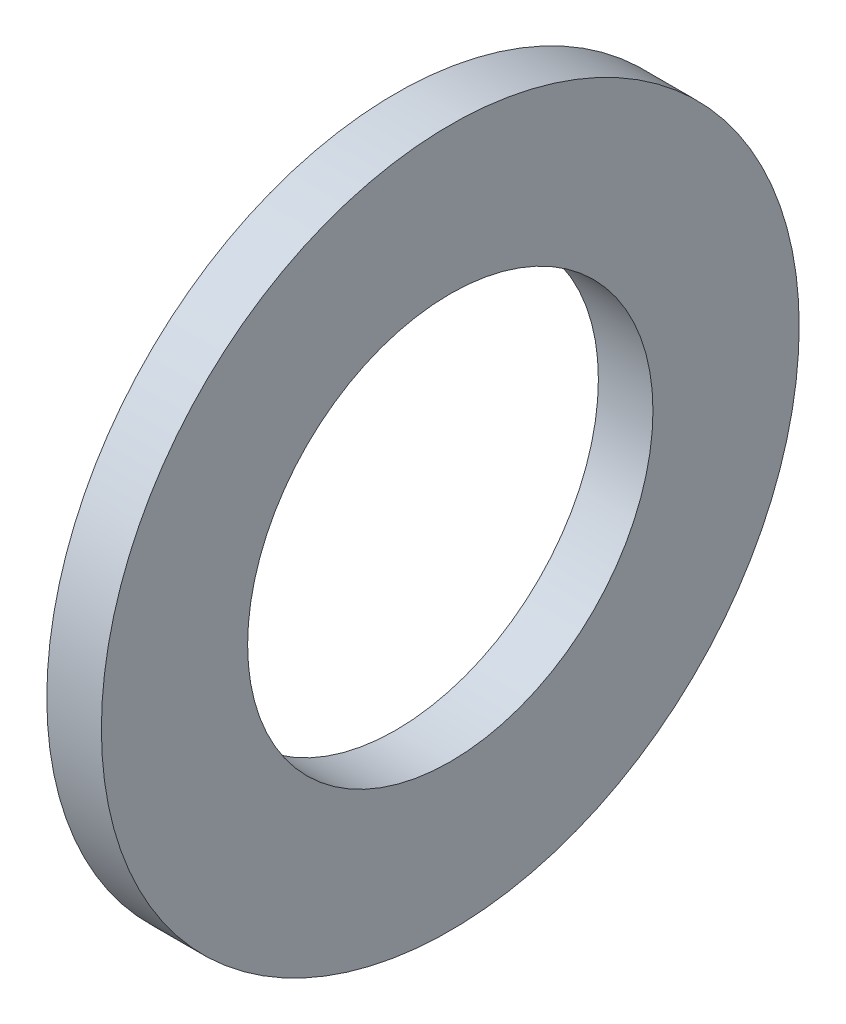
ISO-10303-21;
HEADER;
FILE_DESCRIPTION(('STEP AP214'),'2;1');
FILE_NAME('part.step','',(''),(''),'','','');
FILE_SCHEMA(('AUTOMOTIVE_DESIGN { 1 0 10303 214 1 1 1 1 }'));
ENDSEC;
DATA;
#1=APPLICATION_CONTEXT('core data for automotive mechanical design processes');
#2=APPLICATION_PROTOCOL_DEFINITION('international standard','automotive_design',2000,#1);
#3=PRODUCT_CONTEXT('',#1,'mechanical');
#4=PRODUCT('Part','Part','',(#3));
#5=PRODUCT_RELATED_PRODUCT_CATEGORY('part','',(#4));
#6=PRODUCT_DEFINITION_FORMATION('','',#4);
#7=PRODUCT_DEFINITION_CONTEXT('part definition',#1,'design');
#8=PRODUCT_DEFINITION('design','',#6,#7);
#9=PRODUCT_DEFINITION_SHAPE('','',#8);
#10=(LENGTH_UNIT() NAMED_UNIT(*) SI_UNIT(.MILLI.,.METRE.));
#11=(NAMED_UNIT(*) PLANE_ANGLE_UNIT() SI_UNIT($,.RADIAN.));
#12=(NAMED_UNIT(*) SI_UNIT($,.STERADIAN.) SOLID_ANGLE_UNIT());
#13=UNCERTAINTY_MEASURE_WITH_UNIT(LENGTH_MEASURE(1.E-05),#10,'distance_accuracy_value','');
#14=(GEOMETRIC_REPRESENTATION_CONTEXT(3) GLOBAL_UNCERTAINTY_ASSIGNED_CONTEXT((#13)) GLOBAL_UNIT_ASSIGNED_CONTEXT((#10,
#11,#12)) REPRESENTATION_CONTEXT('',''));
#15=CARTESIAN_POINT('',(0.,0.,0.));
#16=DIRECTION('',(0.,0.,1.));
#17=DIRECTION('',(1.,0.,0.));
#18=AXIS2_PLACEMENT_3D('',#15,#16,#17);
#19=CARTESIAN_POINT('',(2.6162,0.,0.));
#20=DIRECTION('',(1.,0.,0.));
#21=DIRECTION('',(0.,0.,-1.));
#22=AXIS2_PLACEMENT_3D('',#19,#20,#21);
#23=PLANE('',#22);
#24=CARTESIAN_POINT('',(2.6162,0.,0.));
#25=DIRECTION('',(1.,0.,0.));
#26=DIRECTION('',(0.,0.,-1.));
#27=AXIS2_PLACEMENT_3D('',#24,#25,#26);
#28=CIRCLE('',#27,16.7259);
#29=CARTESIAN_POINT('',(2.6162,0.,-16.7259));
#30=VERTEX_POINT('',#29);
#31=EDGE_CURVE('E10',#30,#30,#28,.T.);
#32=ORIENTED_EDGE('',*,*,#31,.T.);
#33=EDGE_LOOP('',(#32));
#34=FACE_BOUND('',#33,.T.);
#35=CARTESIAN_POINT('',(2.6162,0.,0.));
#36=DIRECTION('',(1.,0.,0.));
#37=DIRECTION('',(0.,0.,-1.));
#38=AXIS2_PLACEMENT_3D('',#35,#36,#37);
#39=CIRCLE('',#38,9.7155);
#40=CARTESIAN_POINT('',(2.6162,0.,-9.7155));
#41=VERTEX_POINT('',#40);
#42=EDGE_CURVE('E47',#41,#41,#39,.T.);
#43=ORIENTED_EDGE('',*,*,#42,.F.);
#44=EDGE_LOOP('',(#43));
#45=FACE_BOUND('',#44,.T.);
#46=ADVANCED_FACE('F36',(#34,#45),#23,.T.);
#47=CARTESIAN_POINT('',(0.,0.,0.));
#48=DIRECTION('',(1.,0.,0.));
#49=DIRECTION('',(0.,0.,-1.));
#50=AXIS2_PLACEMENT_3D('',#47,#48,#49);
#51=PLANE('',#50);
#52=CARTESIAN_POINT('',(0.,0.,0.));
#53=DIRECTION('',(1.,0.,0.));
#54=DIRECTION('',(0.,0.,-1.));
#55=AXIS2_PLACEMENT_3D('',#52,#53,#54);
#56=CIRCLE('',#55,16.7259);
#57=CARTESIAN_POINT('',(0.,0.,-16.7259));
#58=VERTEX_POINT('',#57);
#59=EDGE_CURVE('E40',#58,#58,#56,.T.);
#60=ORIENTED_EDGE('',*,*,#59,.F.);
#61=EDGE_LOOP('',(#60));
#62=FACE_BOUND('',#61,.T.);
#63=CARTESIAN_POINT('',(0.,0.,0.));
#64=DIRECTION('',(1.,0.,0.));
#65=DIRECTION('',(0.,0.,-1.));
#66=AXIS2_PLACEMENT_3D('',#63,#64,#65);
#67=CIRCLE('',#66,9.7155);
#68=CARTESIAN_POINT('',(0.,0.,-9.7155));
#69=VERTEX_POINT('',#68);
#70=EDGE_CURVE('E49',#69,#69,#67,.T.);
#71=ORIENTED_EDGE('',*,*,#70,.T.);
#72=EDGE_LOOP('',(#71));
#73=FACE_BOUND('',#72,.T.);
#74=ADVANCED_FACE('F59',(#62,#73),#51,.F.);
#75=CARTESIAN_POINT('',(2.6162,0.,0.));
#76=DIRECTION('',(-1.,0.,0.));
#77=DIRECTION('',(0.,0.,1.));
#78=AXIS2_PLACEMENT_3D('',#75,#76,#77);
#79=CYLINDRICAL_SURFACE('',#78,16.7259);
#80=ORIENTED_EDGE('',*,*,#31,.F.);
#81=EDGE_LOOP('',(#80));
#82=FACE_BOUND('',#81,.T.);
#83=ORIENTED_EDGE('',*,*,#59,.T.);
#84=EDGE_LOOP('',(#83));
#85=FACE_BOUND('',#84,.T.);
#86=ADVANCED_FACE('F38',(#82,#85),#79,.T.);
#87=CARTESIAN_POINT('',(2.6162,0.,0.));
#88=DIRECTION('',(-1.,0.,0.));
#89=DIRECTION('',(0.,0.,1.));
#90=AXIS2_PLACEMENT_3D('',#87,#88,#89);
#91=CYLINDRICAL_SURFACE('',#90,9.7155);
#92=ORIENTED_EDGE('',*,*,#42,.T.);
#93=EDGE_LOOP('',(#92));
#94=FACE_BOUND('',#93,.T.);
#95=ORIENTED_EDGE('',*,*,#70,.F.);
#96=EDGE_LOOP('',(#95));
#97=FACE_BOUND('',#96,.T.);
#98=ADVANCED_FACE('F55',(#94,#97),#91,.F.);
#99=CLOSED_SHELL('',(#46,#74,#86,#98));
#100=MANIFOLD_SOLID_BREP('B2',#99);
#101=ADVANCED_BREP_SHAPE_REPRESENTATION('',(#18,#100),#14);
#102=SHAPE_DEFINITION_REPRESENTATION(#9,#101);
ENDSEC;
END-ISO-10303-21;
